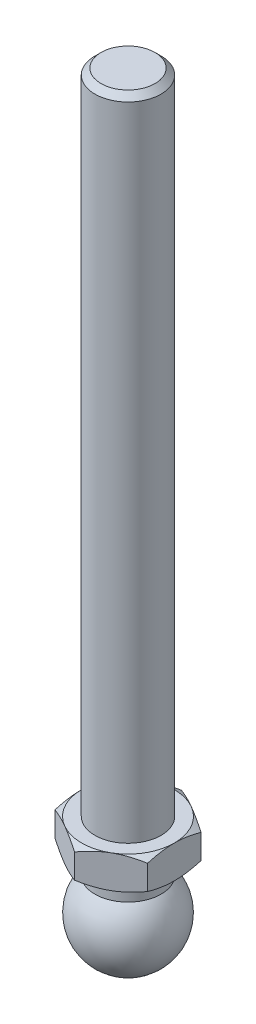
ISO-10303-21;
HEADER;
FILE_DESCRIPTION(('STEP AP214'),'2;1');
FILE_NAME('part.step','',(''),(''),'','','');
FILE_SCHEMA(('AUTOMOTIVE_DESIGN { 1 0 10303 214 1 1 1 1 }'));
ENDSEC;
DATA;
#1=APPLICATION_CONTEXT('core data for automotive mechanical design processes');
#2=APPLICATION_PROTOCOL_DEFINITION('international standard','automotive_design',2000,#1);
#3=PRODUCT_CONTEXT('',#1,'mechanical');
#4=PRODUCT('Part','Part','',(#3));
#5=PRODUCT_RELATED_PRODUCT_CATEGORY('part','',(#4));
#6=PRODUCT_DEFINITION_FORMATION('','',#4);
#7=PRODUCT_DEFINITION_CONTEXT('part definition',#1,'design');
#8=PRODUCT_DEFINITION('design','',#6,#7);
#9=PRODUCT_DEFINITION_SHAPE('','',#8);
#10=(LENGTH_UNIT() NAMED_UNIT(*) SI_UNIT(.MILLI.,.METRE.));
#11=(NAMED_UNIT(*) PLANE_ANGLE_UNIT() SI_UNIT($,.RADIAN.));
#12=(NAMED_UNIT(*) SI_UNIT($,.STERADIAN.) SOLID_ANGLE_UNIT());
#13=UNCERTAINTY_MEASURE_WITH_UNIT(LENGTH_MEASURE(1.E-05),#10,'distance_accuracy_value','');
#14=(GEOMETRIC_REPRESENTATION_CONTEXT(3) GLOBAL_UNCERTAINTY_ASSIGNED_CONTEXT((#13)) GLOBAL_UNIT_ASSIGNED_CONTEXT((#10,
#11,#12)) REPRESENTATION_CONTEXT('',''));
#15=CARTESIAN_POINT('',(0.,0.,0.));
#16=DIRECTION('',(0.,0.,1.));
#17=DIRECTION('',(1.,0.,0.));
#18=AXIS2_PLACEMENT_3D('',#15,#16,#17);
#19=CARTESIAN_POINT('',(0.,12.6,0.));
#20=DIRECTION('',(0.,-1.,0.));
#21=DIRECTION('',(0.,0.,-1.));
#22=AXIS2_PLACEMENT_3D('',#19,#20,#21);
#23=CONICAL_SURFACE('',#22,7.,1.0471975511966);
#24=CARTESIAN_POINT('',(-7.,8.53828268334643,12.1648696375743));
#25=CARTESIAN_POINT('',(-7.,8.68391573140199,11.8738003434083));
#26=CARTESIAN_POINT('',(-7.,8.82854589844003,11.5822239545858));
#27=CARTESIAN_POINT('',(-7.,9.11531569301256,10.997825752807));
#28=CARTESIAN_POINT('',(-7.,9.25745515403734,10.7050038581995));
#29=CARTESIAN_POINT('',(-7.,9.53902214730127,10.117331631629));
#30=CARTESIAN_POINT('',(-7.,9.67844364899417,9.8224784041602));
#31=CARTESIAN_POINT('',(-7.,9.95360604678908,9.23106328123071));
#32=CARTESIAN_POINT('',(-7.,10.0893470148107,8.9345014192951));
#33=CARTESIAN_POINT('',(-7.,10.3623110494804,8.325935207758));
#34=CARTESIAN_POINT('',(-7.,10.4993254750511,8.0138369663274));
#35=CARTESIAN_POINT('',(-7.,10.7671383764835,7.38695797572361));
#36=CARTESIAN_POINT('',(-7.,10.8979365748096,7.07217710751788));
#37=CARTESIAN_POINT('',(-7.,11.1515530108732,6.43962449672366));
#38=CARTESIAN_POINT('',(-7.,11.274376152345,6.12185473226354));
#39=CARTESIAN_POINT('',(-7.,11.5099016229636,5.4826031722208));
#40=CARTESIAN_POINT('',(-7.,11.6226050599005,5.16112178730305));
#41=CARTESIAN_POINT('',(-7.,11.8599014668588,4.43821731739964));
#42=CARTESIAN_POINT('',(-7.,11.981118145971,4.03566892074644));
#43=CARTESIAN_POINT('',(-7.,12.1969740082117,3.22331060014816));
#44=CARTESIAN_POINT('',(-7.,12.2916155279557,2.81350131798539));
#45=CARTESIAN_POINT('',(-7.,12.4069999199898,2.1974256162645));
#46=CARTESIAN_POINT('',(-7.,12.4408518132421,1.99359214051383));
#47=CARTESIAN_POINT('',(-7.,12.4993191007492,1.58461613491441));
#48=CARTESIAN_POINT('',(-7.,12.5239358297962,1.37947379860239));
#49=CARTESIAN_POINT('',(-7.,12.5631968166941,0.968289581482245));
#50=CARTESIAN_POINT('',(-7.,12.5778439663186,0.762247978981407));
#51=CARTESIAN_POINT('',(-7.,12.5967021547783,0.349683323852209));
#52=CARTESIAN_POINT('',(-7.,12.6009132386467,0.143160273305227));
#53=CARTESIAN_POINT('',(-7.,12.5987493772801,-0.271082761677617));
#54=CARTESIAN_POINT('',(-7.,12.5923100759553,-0.478802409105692));
#55=CARTESIAN_POINT('',(-7.,12.5689433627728,-0.893645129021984));
#56=CARTESIAN_POINT('',(-7.,12.5520159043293,-1.10076819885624));
#57=CARTESIAN_POINT('',(-7.,12.5082124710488,-1.5140304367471));
#58=CARTESIAN_POINT('',(-7.,12.4813327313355,-1.72016920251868));
#59=CARTESIAN_POINT('',(-7.,12.4184180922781,-2.13103319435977));
#60=CARTESIAN_POINT('',(-7.,12.3823828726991,-2.33575837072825));
#61=CARTESIAN_POINT('',(-7.,12.2605686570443,-2.95437912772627));
#62=CARTESIAN_POINT('',(-7.,12.1618729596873,-3.36575077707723));
#63=CARTESIAN_POINT('',(-7.,11.9384533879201,-4.18138012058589));
#64=CARTESIAN_POINT('',(-7.,11.8137148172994,-4.58563365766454));
#65=CARTESIAN_POINT('',(-7.,11.5733248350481,-5.30320893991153));
#66=CARTESIAN_POINT('',(-7.,11.4612875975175,-5.6177595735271));
#67=CARTESIAN_POINT('',(-7.,11.2278514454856,-6.24325021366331));
#68=CARTESIAN_POINT('',(-7.,11.1064551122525,-6.55419118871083));
#69=CARTESIAN_POINT('',(-7.,10.8562070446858,-7.17328528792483));
#70=CARTESIAN_POINT('',(-7.,10.7273503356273,-7.48143638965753));
#71=CARTESIAN_POINT('',(-7.,10.4637823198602,-8.09523802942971));
#72=CARTESIAN_POINT('',(-7.,10.3290706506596,-8.40088841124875));
#73=CARTESIAN_POINT('',(-7.,10.0607840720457,-8.99716345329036));
#74=CARTESIAN_POINT('',(-7.,9.92740317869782,-9.2878756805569));
#75=CARTESIAN_POINT('',(-7.,9.65714715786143,-9.86766295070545));
#76=CARTESIAN_POINT('',(-7.,9.52027208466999,-10.1567380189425));
#77=CARTESIAN_POINT('',(-7.,9.24389786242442,-10.7329937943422));
#78=CARTESIAN_POINT('',(-7.,9.10440383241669,-11.0201769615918));
#79=CARTESIAN_POINT('',(-7.,8.82302286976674,-11.5933594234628));
#80=CARTESIAN_POINT('',(-7.,8.68113600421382,-11.879358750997));
#81=CARTESIAN_POINT('',(-7.,8.53828268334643,-12.1648696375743));
#82=B_SPLINE_CURVE_WITH_KNOTS('',3,(#24,#25,#26,#27,#28,#29,#30,#31,#32,#33,#34,#35,#36,#37,#38,
#39,#40,#41,#42,#43,#44,#45,#46,#47,#48,#49,#50,#51,#52,#53,#54,#55,#56,#57,#58,#59,#60,#61,#62,
#63,#64,#65,#66,#67,#68,#69,#70,#71,#72,#73,#74,#75,#76,#77,#78,#79,#80,#81),.UNSPECIFIED.,.F.,
.F.,(4,2,2,2,2,2,2,2,2,2,2,2,2,2,2,2,2,2,2,2,2,2,2,2,2,2,2,2,4),(0.,0.976413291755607,
1.95289161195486,2.93133423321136,3.90975772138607,4.93225217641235,5.95479223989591,
6.97669748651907,7.99849072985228,9.25906449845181,10.5195273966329,11.1392271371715,
11.7588372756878,12.3782676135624,12.9976952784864,13.6208795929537,14.2440666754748,
14.8674897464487,15.490934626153,16.7587972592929,18.027377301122,19.0289263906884,
20.0302002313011,21.0321496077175,22.0341611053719,22.9936838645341,23.9531917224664,
24.9109871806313,25.8687558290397),.UNSPECIFIED.);
#83=CARTESIAN_POINT('',(-7.,11.9747852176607,4.04145188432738));
#84=VERTEX_POINT('',#83);
#85=CARTESIAN_POINT('',(-7.,12.6,0.));
#86=VERTEX_POINT('',#85);
#87=EDGE_CURVE('E309',#84,#86,#82,.T.);
#88=ORIENTED_EDGE('',*,*,#87,.F.);
#89=CARTESIAN_POINT('',(0.0002,11.9747185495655,8.0830192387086));
#90=CARTESIAN_POINT('',(-0.153667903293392,12.0260001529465,7.99418356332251));
#91=CARTESIAN_POINT('',(-0.30810950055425,12.0749544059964,7.90501666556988));
#92=CARTESIAN_POINT('',(-0.618246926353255,12.1675672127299,7.72595873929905));
#93=CARTESIAN_POINT('',(-0.773943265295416,12.2112234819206,7.63606741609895));
#94=CARTESIAN_POINT('',(-1.24352516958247,12.3333884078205,7.36495417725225));
#95=CARTESIAN_POINT('',(-1.5592643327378,12.402874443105,7.18266208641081));
#96=CARTESIAN_POINT('',(-2.03176224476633,12.4843550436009,6.9098652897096));
#97=CARTESIAN_POINT('',(-2.18710922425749,12.5075665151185,6.82017566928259));
#98=CARTESIAN_POINT('',(-2.49850511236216,12.5464887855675,6.64039116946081));
#99=CARTESIAN_POINT('',(-2.65455395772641,12.5622002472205,6.55029632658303));
#100=CARTESIAN_POINT('',(-2.96692267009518,12.5857220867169,6.36995016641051));
#101=CARTESIAN_POINT('',(-3.12324202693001,12.5935414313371,6.27969914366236));
#102=CARTESIAN_POINT('',(-3.43601650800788,12.6011197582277,6.09911871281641));
#103=CARTESIAN_POINT('',(-3.59247162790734,12.600878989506,6.00878930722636));
#104=CARTESIAN_POINT('',(-4.02110687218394,12.5891402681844,5.76131663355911));
#105=CARTESIAN_POINT('',(-4.2931466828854,12.5694342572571,5.60425437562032));
#106=CARTESIAN_POINT('',(-4.8354194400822,12.5069465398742,5.29117305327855));
#107=CARTESIAN_POINT('',(-5.10565047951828,12.464143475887,5.13515508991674));
#108=CARTESIAN_POINT('',(-5.64901454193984,12.3571483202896,4.82144370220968));
#109=CARTESIAN_POINT('',(-5.92207900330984,12.2925029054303,4.66378986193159));
#110=CARTESIAN_POINT('',(-6.46413578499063,12.145783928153,4.35083323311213));
#111=CARTESIAN_POINT('',(-6.73313504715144,12.0637448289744,4.19552643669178));
#112=CARTESIAN_POINT('',(-7.0002,11.9747185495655,4.04133641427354));
#113=B_SPLINE_CURVE_WITH_KNOTS('',3,(#89,#90,#91,#92,#93,#94,#95,#96,#97,#98,#99,#100,#101,#102,
#103,#104,#105,#106,#107,#108,#109,#110,#111,#112),.UNSPECIFIED.,.F.,.F.,(4,2,2,2,2,2,2,2,2,2,2,
4),(0.,0.554727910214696,1.10969417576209,2.2219327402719,2.76443041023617,3.30688013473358,
3.8487128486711,4.3905288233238,5.33376515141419,6.27787517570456,7.2429241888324,
8.20607866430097),.UNSPECIFIED.);
#114=CARTESIAN_POINT('',(-3.5,12.6,6.06217782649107));
#115=VERTEX_POINT('',#114);
#116=EDGE_CURVE('E135',#115,#84,#113,.T.);
#117=ORIENTED_EDGE('',*,*,#116,.F.);
#118=CARTESIAN_POINT('',(0.,12.6,0.));
#119=DIRECTION('',(0.,-1.,0.));
#120=DIRECTION('',(0.,0.,-1.));
#121=AXIS2_PLACEMENT_3D('',#118,#119,#120);
#122=CIRCLE('',#121,7.);
#123=EDGE_CURVE('E283',#115,#86,#122,.T.);
#124=ORIENTED_EDGE('',*,*,#123,.T.);
#125=EDGE_LOOP('',(#88,#117,#124));
#126=FACE_BOUND('',#125,.T.);
#127=ADVANCED_FACE('F14',(#126),#23,.T.);
#128=CARTESIAN_POINT('',(-7.,11.9747852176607,-4.04145188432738));
#129=VERTEX_POINT('',#128);
#130=EDGE_CURVE('E193',#86,#129,#82,.T.);
#131=ORIENTED_EDGE('',*,*,#130,.F.);
#132=CARTESIAN_POINT('',(-3.5,12.6,-6.06217782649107));
#133=VERTEX_POINT('',#132);
#134=EDGE_CURVE('E195',#86,#133,#122,.T.);
#135=ORIENTED_EDGE('',*,*,#134,.T.);
#136=CARTESIAN_POINT('',(-7.0002,11.9747185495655,-4.04133641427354));
#137=CARTESIAN_POINT('',(-6.84633209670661,12.0260001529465,-4.13017208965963));
#138=CARTESIAN_POINT('',(-6.69189049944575,12.0749544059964,-4.21933898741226));
#139=CARTESIAN_POINT('',(-6.38175307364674,12.1675672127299,-4.39839691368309));
#140=CARTESIAN_POINT('',(-6.22605673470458,12.2112234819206,-4.48828823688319));
#141=CARTESIAN_POINT('',(-5.75647483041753,12.3333884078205,-4.75940147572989));
#142=CARTESIAN_POINT('',(-5.4407356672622,12.402874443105,-4.94169356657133));
#143=CARTESIAN_POINT('',(-4.96823775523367,12.4843550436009,-5.21449036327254));
#144=CARTESIAN_POINT('',(-4.81289077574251,12.5075665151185,-5.30417998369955));
#145=CARTESIAN_POINT('',(-4.50149488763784,12.5464887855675,-5.48396448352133));
#146=CARTESIAN_POINT('',(-4.34544604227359,12.5622002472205,-5.57405932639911));
#147=CARTESIAN_POINT('',(-4.03307732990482,12.5857220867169,-5.75440548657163));
#148=CARTESIAN_POINT('',(-3.87675797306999,12.5935414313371,-5.84465650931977));
#149=CARTESIAN_POINT('',(-3.56398349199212,12.6011197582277,-6.02523694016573));
#150=CARTESIAN_POINT('',(-3.40752837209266,12.600878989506,-6.11556634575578));
#151=CARTESIAN_POINT('',(-2.97889312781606,12.5891402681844,-6.36303901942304));
#152=CARTESIAN_POINT('',(-2.7068533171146,12.5694342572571,-6.52010127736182));
#153=CARTESIAN_POINT('',(-2.1645805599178,12.5069465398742,-6.83318259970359));
#154=CARTESIAN_POINT('',(-1.89434952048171,12.464143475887,-6.9892005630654));
#155=CARTESIAN_POINT('',(-1.35098545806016,12.3571483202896,-7.30291195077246));
#156=CARTESIAN_POINT('',(-1.07792099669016,12.2925029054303,-7.46056579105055));
#157=CARTESIAN_POINT('',(-0.535864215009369,12.145783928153,-7.77352241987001));
#158=CARTESIAN_POINT('',(-0.266864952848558,12.0637448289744,-7.92882921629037));
#159=CARTESIAN_POINT('',(0.000200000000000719,11.9747185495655,-8.0830192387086));
#160=B_SPLINE_CURVE_WITH_KNOTS('',3,(#136,#137,#138,#139,#140,#141,#142,#143,#144,#145,#146,
#147,#148,#149,#150,#151,#152,#153,#154,#155,#156,#157,#158,#159),.UNSPECIFIED.,.F.,.F.,(4,2,2,
2,2,2,2,2,2,2,2,4),(0.,0.554727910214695,1.10969417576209,2.2219327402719,2.76443041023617,
3.30688013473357,3.8487128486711,4.39052882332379,5.33376515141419,6.27787517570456,
7.2429241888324,8.20607866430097),.UNSPECIFIED.);
#161=EDGE_CURVE('E183',#129,#133,#160,.T.);
#162=ORIENTED_EDGE('',*,*,#161,.F.);
#163=EDGE_LOOP('',(#131,#135,#162));
#164=FACE_BOUND('',#163,.T.);
#165=ADVANCED_FACE('F192',(#164),#23,.T.);
#166=CARTESIAN_POINT('',(0.,11.9747852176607,-8.08290376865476));
#167=VERTEX_POINT('',#166);
#168=EDGE_CURVE('E197',#133,#167,#160,.T.);
#169=ORIENTED_EDGE('',*,*,#168,.F.);
#170=CARTESIAN_POINT('',(3.5,12.6,-6.06217782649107));
#171=VERTEX_POINT('',#170);
#172=EDGE_CURVE('E293',#133,#171,#122,.T.);
#173=ORIENTED_EDGE('',*,*,#172,.T.);
#174=CARTESIAN_POINT('',(-0.0002,11.9747185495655,-8.0830192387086));
#175=CARTESIAN_POINT('',(0.153667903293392,12.0260001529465,-7.99418356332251));
#176=CARTESIAN_POINT('',(0.30810950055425,12.0749544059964,-7.90501666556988));
#177=CARTESIAN_POINT('',(0.618246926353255,12.1675672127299,-7.72595873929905));
#178=CARTESIAN_POINT('',(0.773943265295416,12.2112234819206,-7.63606741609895));
#179=CARTESIAN_POINT('',(1.24352516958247,12.3333884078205,-7.36495417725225));
#180=CARTESIAN_POINT('',(1.5592643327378,12.402874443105,-7.18266208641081));
#181=CARTESIAN_POINT('',(2.03176224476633,12.4843550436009,-6.9098652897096));
#182=CARTESIAN_POINT('',(2.18710922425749,12.5075665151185,-6.82017566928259));
#183=CARTESIAN_POINT('',(2.49850511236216,12.5464887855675,-6.64039116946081));
#184=CARTESIAN_POINT('',(2.65455395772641,12.5622002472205,-6.55029632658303));
#185=CARTESIAN_POINT('',(2.96692267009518,12.5857220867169,-6.36995016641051));
#186=CARTESIAN_POINT('',(3.12324202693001,12.5935414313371,-6.27969914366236));
#187=CARTESIAN_POINT('',(3.43601650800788,12.6011197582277,-6.09911871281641));
#188=CARTESIAN_POINT('',(3.59247162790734,12.600878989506,-6.00878930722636));
#189=CARTESIAN_POINT('',(4.02110687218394,12.5891402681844,-5.76131663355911));
#190=CARTESIAN_POINT('',(4.2931466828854,12.5694342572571,-5.60425437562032));
#191=CARTESIAN_POINT('',(4.8354194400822,12.5069465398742,-5.29117305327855));
#192=CARTESIAN_POINT('',(5.10565047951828,12.464143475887,-5.13515508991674));
#193=CARTESIAN_POINT('',(5.64901454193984,12.3571483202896,-4.82144370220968));
#194=CARTESIAN_POINT('',(5.92207900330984,12.2925029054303,-4.66378986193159));
#195=CARTESIAN_POINT('',(6.46413578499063,12.145783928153,-4.35083323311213));
#196=CARTESIAN_POINT('',(6.73313504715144,12.0637448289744,-4.19552643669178));
#197=CARTESIAN_POINT('',(7.0002,11.9747185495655,-4.04133641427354));
#198=B_SPLINE_CURVE_WITH_KNOTS('',3,(#174,#175,#176,#177,#178,#179,#180,#181,#182,#183,#184,
#185,#186,#187,#188,#189,#190,#191,#192,#193,#194,#195,#196,#197),.UNSPECIFIED.,.F.,.F.,(4,2,2,
2,2,2,2,2,2,2,2,4),(0.,0.554727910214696,1.10969417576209,2.2219327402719,2.76443041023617,
3.30688013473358,3.8487128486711,4.3905288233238,5.33376515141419,6.27787517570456,
7.2429241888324,8.20607866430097),.UNSPECIFIED.);
#199=EDGE_CURVE('E243',#167,#171,#198,.T.);
#200=ORIENTED_EDGE('',*,*,#199,.F.);
#201=EDGE_LOOP('',(#169,#173,#200));
#202=FACE_BOUND('',#201,.T.);
#203=ADVANCED_FACE('F342',(#202),#23,.T.);
#204=CARTESIAN_POINT('',(7.,11.9747852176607,-4.04145188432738));
#205=VERTEX_POINT('',#204);
#206=EDGE_CURVE('E238',#171,#205,#198,.T.);
#207=ORIENTED_EDGE('',*,*,#206,.F.);
#208=CARTESIAN_POINT('',(7.,12.6,0.));
#209=VERTEX_POINT('',#208);
#210=EDGE_CURVE('E288',#171,#209,#122,.T.);
#211=ORIENTED_EDGE('',*,*,#210,.T.);
#212=CARTESIAN_POINT('',(7.,8.53828268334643,-12.1648696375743));
#213=CARTESIAN_POINT('',(7.,8.68391573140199,-11.8738003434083));
#214=CARTESIAN_POINT('',(7.,8.82854589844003,-11.5822239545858));
#215=CARTESIAN_POINT('',(7.,9.11531569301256,-10.997825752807));
#216=CARTESIAN_POINT('',(7.,9.25745515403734,-10.7050038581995));
#217=CARTESIAN_POINT('',(7.,9.53902214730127,-10.117331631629));
#218=CARTESIAN_POINT('',(7.,9.67844364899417,-9.8224784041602));
#219=CARTESIAN_POINT('',(7.,9.95360604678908,-9.23106328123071));
#220=CARTESIAN_POINT('',(7.,10.0893470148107,-8.9345014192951));
#221=CARTESIAN_POINT('',(7.,10.3623110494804,-8.325935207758));
#222=CARTESIAN_POINT('',(7.,10.4993254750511,-8.0138369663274));
#223=CARTESIAN_POINT('',(7.,10.7671383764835,-7.38695797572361));
#224=CARTESIAN_POINT('',(7.,10.8979365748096,-7.07217710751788));
#225=CARTESIAN_POINT('',(7.,11.1515530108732,-6.43962449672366));
#226=CARTESIAN_POINT('',(7.,11.274376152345,-6.12185473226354));
#227=CARTESIAN_POINT('',(7.,11.5099016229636,-5.4826031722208));
#228=CARTESIAN_POINT('',(7.,11.6226050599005,-5.16112178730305));
#229=CARTESIAN_POINT('',(7.,11.8599014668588,-4.43821731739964));
#230=CARTESIAN_POINT('',(7.,11.981118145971,-4.03566892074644));
#231=CARTESIAN_POINT('',(7.,12.1969740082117,-3.22331060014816));
#232=CARTESIAN_POINT('',(7.,12.2916155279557,-2.81350131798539));
#233=CARTESIAN_POINT('',(7.,12.4069999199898,-2.1974256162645));
#234=CARTESIAN_POINT('',(7.,12.4408518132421,-1.99359214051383));
#235=CARTESIAN_POINT('',(7.,12.4993191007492,-1.58461613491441));
#236=CARTESIAN_POINT('',(7.,12.5239358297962,-1.37947379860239));
#237=CARTESIAN_POINT('',(7.,12.5631968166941,-0.968289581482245));
#238=CARTESIAN_POINT('',(7.,12.5778439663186,-0.762247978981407));
#239=CARTESIAN_POINT('',(7.,12.5967021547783,-0.349683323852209));
#240=CARTESIAN_POINT('',(7.,12.6009132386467,-0.143160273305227));
#241=CARTESIAN_POINT('',(7.,12.5987493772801,0.271082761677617));
#242=CARTESIAN_POINT('',(7.,12.5923100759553,0.478802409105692));
#243=CARTESIAN_POINT('',(7.,12.5689433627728,0.893645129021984));
#244=CARTESIAN_POINT('',(7.,12.5520159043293,1.10076819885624));
#245=CARTESIAN_POINT('',(7.,12.5082124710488,1.5140304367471));
#246=CARTESIAN_POINT('',(7.,12.4813327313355,1.72016920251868));
#247=CARTESIAN_POINT('',(7.,12.4184180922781,2.13103319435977));
#248=CARTESIAN_POINT('',(7.,12.3823828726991,2.33575837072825));
#249=CARTESIAN_POINT('',(7.,12.2605686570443,2.95437912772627));
#250=CARTESIAN_POINT('',(7.,12.1618729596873,3.36575077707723));
#251=CARTESIAN_POINT('',(7.,11.9384533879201,4.18138012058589));
#252=CARTESIAN_POINT('',(7.,11.8137148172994,4.58563365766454));
#253=CARTESIAN_POINT('',(7.,11.5733248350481,5.30320893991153));
#254=CARTESIAN_POINT('',(7.,11.4612875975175,5.6177595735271));
#255=CARTESIAN_POINT('',(7.,11.2278514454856,6.24325021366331));
#256=CARTESIAN_POINT('',(7.,11.1064551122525,6.55419118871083));
#257=CARTESIAN_POINT('',(7.,10.8562070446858,7.17328528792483));
#258=CARTESIAN_POINT('',(7.,10.7273503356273,7.48143638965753));
#259=CARTESIAN_POINT('',(7.,10.4637823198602,8.09523802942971));
#260=CARTESIAN_POINT('',(7.,10.3290706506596,8.40088841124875));
#261=CARTESIAN_POINT('',(7.,10.0607840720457,8.99716345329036));
#262=CARTESIAN_POINT('',(7.,9.92740317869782,9.2878756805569));
#263=CARTESIAN_POINT('',(7.,9.65714715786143,9.86766295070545));
#264=CARTESIAN_POINT('',(7.,9.52027208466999,10.1567380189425));
#265=CARTESIAN_POINT('',(7.,9.24389786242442,10.7329937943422));
#266=CARTESIAN_POINT('',(7.,9.10440383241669,11.0201769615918));
#267=CARTESIAN_POINT('',(7.,8.82302286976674,11.5933594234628));
#268=CARTESIAN_POINT('',(7.,8.68113600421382,11.879358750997));
#269=CARTESIAN_POINT('',(7.,8.53828268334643,12.1648696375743));
#270=B_SPLINE_CURVE_WITH_KNOTS('',3,(#212,#213,#214,#215,#216,#217,#218,#219,#220,#221,#222,
#223,#224,#225,#226,#227,#228,#229,#230,#231,#232,#233,#234,#235,#236,#237,#238,#239,#240,#241,
#242,#243,#244,#245,#246,#247,#248,#249,#250,#251,#252,#253,#254,#255,#256,#257,#258,#259,#260,
#261,#262,#263,#264,#265,#266,#267,#268,#269),.UNSPECIFIED.,.F.,.F.,(4,2,2,2,2,2,2,2,2,2,2,2,2,
2,2,2,2,2,2,2,2,2,2,2,2,2,2,2,4),(0.,0.976413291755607,1.95289161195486,2.93133423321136,
3.90975772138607,4.93225217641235,5.95479223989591,6.97669748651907,7.99849072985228,
9.25906449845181,10.5195273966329,11.1392271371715,11.7588372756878,12.3782676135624,
12.9976952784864,13.6208795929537,14.2440666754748,14.8674897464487,15.490934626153,
16.7587972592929,18.027377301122,19.0289263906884,20.0302002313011,21.0321496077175,
22.0341611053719,22.9936838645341,23.9531917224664,24.9109871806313,25.8687558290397),.UNSPECIFIED.);
#271=EDGE_CURVE('E249',#205,#209,#270,.T.);
#272=ORIENTED_EDGE('',*,*,#271,.F.);
#273=EDGE_LOOP('',(#207,#211,#272));
#274=FACE_BOUND('',#273,.T.);
#275=ADVANCED_FACE('F352',(#274),#23,.T.);
#276=CARTESIAN_POINT('',(7.,11.9747852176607,4.04145188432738));
#277=VERTEX_POINT('',#276);
#278=EDGE_CURVE('E251',#209,#277,#270,.T.);
#279=ORIENTED_EDGE('',*,*,#278,.F.);
#280=CARTESIAN_POINT('',(3.5,12.6,6.06217782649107));
#281=VERTEX_POINT('',#280);
#282=EDGE_CURVE('E281',#209,#281,#122,.T.);
#283=ORIENTED_EDGE('',*,*,#282,.T.);
#284=CARTESIAN_POINT('',(7.0002,11.9747185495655,4.04133641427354));
#285=CARTESIAN_POINT('',(6.84633209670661,12.0260001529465,4.13017208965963));
#286=CARTESIAN_POINT('',(6.69189049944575,12.0749544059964,4.21933898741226));
#287=CARTESIAN_POINT('',(6.38175307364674,12.1675672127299,4.39839691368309));
#288=CARTESIAN_POINT('',(6.22605673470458,12.2112234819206,4.48828823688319));
#289=CARTESIAN_POINT('',(5.75647483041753,12.3333884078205,4.75940147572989));
#290=CARTESIAN_POINT('',(5.4407356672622,12.402874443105,4.94169356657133));
#291=CARTESIAN_POINT('',(4.96823775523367,12.4843550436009,5.21449036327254));
#292=CARTESIAN_POINT('',(4.81289077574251,12.5075665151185,5.30417998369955));
#293=CARTESIAN_POINT('',(4.50149488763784,12.5464887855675,5.48396448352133));
#294=CARTESIAN_POINT('',(4.34544604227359,12.5622002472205,5.57405932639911));
#295=CARTESIAN_POINT('',(4.03307732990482,12.5857220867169,5.75440548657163));
#296=CARTESIAN_POINT('',(3.87675797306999,12.5935414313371,5.84465650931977));
#297=CARTESIAN_POINT('',(3.56398349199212,12.6011197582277,6.02523694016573));
#298=CARTESIAN_POINT('',(3.40752837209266,12.600878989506,6.11556634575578));
#299=CARTESIAN_POINT('',(2.97889312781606,12.5891402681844,6.36303901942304));
#300=CARTESIAN_POINT('',(2.7068533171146,12.5694342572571,6.52010127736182));
#301=CARTESIAN_POINT('',(2.1645805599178,12.5069465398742,6.83318259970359));
#302=CARTESIAN_POINT('',(1.89434952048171,12.464143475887,6.9892005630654));
#303=CARTESIAN_POINT('',(1.35098545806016,12.3571483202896,7.30291195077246));
#304=CARTESIAN_POINT('',(1.07792099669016,12.2925029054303,7.46056579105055));
#305=CARTESIAN_POINT('',(0.535864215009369,12.145783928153,7.77352241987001));
#306=CARTESIAN_POINT('',(0.266864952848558,12.0637448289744,7.92882921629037));
#307=CARTESIAN_POINT('',(-0.000200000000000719,11.9747185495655,8.0830192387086));
#308=B_SPLINE_CURVE_WITH_KNOTS('',3,(#284,#285,#286,#287,#288,#289,#290,#291,#292,#293,#294,
#295,#296,#297,#298,#299,#300,#301,#302,#303,#304,#305,#306,#307),.UNSPECIFIED.,.F.,.F.,(4,2,2,
2,2,2,2,2,2,2,2,4),(0.,0.554727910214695,1.10969417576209,2.2219327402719,2.76443041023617,
3.30688013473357,3.8487128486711,4.39052882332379,5.33376515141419,6.27787517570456,
7.2429241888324,8.20607866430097),.UNSPECIFIED.);
#309=EDGE_CURVE('E126',#277,#281,#308,.T.);
#310=ORIENTED_EDGE('',*,*,#309,.F.);
#311=EDGE_LOOP('',(#279,#283,#310));
#312=FACE_BOUND('',#311,.T.);
#313=ADVANCED_FACE('F285',(#312),#23,.T.);
#314=CARTESIAN_POINT('',(0.,11.9747852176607,8.08290376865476));
#315=VERTEX_POINT('',#314);
#316=EDGE_CURVE('E116',#281,#315,#308,.T.);
#317=ORIENTED_EDGE('',*,*,#316,.F.);
#318=EDGE_CURVE('E274',#281,#115,#122,.T.);
#319=ORIENTED_EDGE('',*,*,#318,.T.);
#320=EDGE_CURVE('E29',#315,#115,#113,.T.);
#321=ORIENTED_EDGE('',*,*,#320,.F.);
#322=EDGE_LOOP('',(#317,#319,#321));
#323=FACE_BOUND('',#322,.T.);
#324=ADVANCED_FACE('F273',(#323),#23,.T.);
#325=CARTESIAN_POINT('',(0.,110.6,0.));
#326=DIRECTION('',(0.,-1.,0.));
#327=DIRECTION('',(0.,0.,-1.));
#328=AXIS2_PLACEMENT_3D('',#325,#326,#327);
#329=PLANE('',#328);
#330=CARTESIAN_POINT('',(0.,110.6,0.));
#331=DIRECTION('',(0.,-1.,0.));
#332=DIRECTION('',(0.,0.,-1.));
#333=AXIS2_PLACEMENT_3D('',#330,#331,#332);
#334=CIRCLE('',#333,4.08);
#335=CARTESIAN_POINT('',(0.,110.6,-4.08));
#336=VERTEX_POINT('',#335);
#337=EDGE_CURVE('E22',#336,#336,#334,.T.);
#338=ORIENTED_EDGE('',*,*,#337,.F.);
#339=EDGE_LOOP('',(#338));
#340=FACE_BOUND('',#339,.T.);
#341=ADVANCED_FACE('F16',(#340),#329,.F.);
#342=CARTESIAN_POINT('',(0.,110.6,0.));
#343=DIRECTION('',(0.,-1.,0.));
#344=DIRECTION('',(0.,0.,-1.));
#345=AXIS2_PLACEMENT_3D('',#342,#343,#344);
#346=CONICAL_SURFACE('',#345,4.08,0.785398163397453);
#347=CARTESIAN_POINT('',(0.,109.68,0.));
#348=DIRECTION('',(0.,-1.,0.));
#349=DIRECTION('',(0.,0.,-1.));
#350=AXIS2_PLACEMENT_3D('',#347,#348,#349);
#351=CIRCLE('',#350,5.);
#352=CARTESIAN_POINT('',(0.,109.68,-5.));
#353=VERTEX_POINT('',#352);
#354=EDGE_CURVE('E290',#353,#353,#351,.T.);
#355=ORIENTED_EDGE('',*,*,#354,.F.);
#356=EDGE_LOOP('',(#355));
#357=FACE_BOUND('',#356,.T.);
#358=ORIENTED_EDGE('',*,*,#337,.T.);
#359=EDGE_LOOP('',(#358));
#360=FACE_BOUND('',#359,.T.);
#361=ADVANCED_FACE('F350',(#357,#360),#346,.T.);
#362=CARTESIAN_POINT('',(0.,-7.,0.));
#363=DIRECTION('',(0.,-1.,0.));
#364=DIRECTION('',(0.,0.,-1.));
#365=AXIS2_PLACEMENT_3D('',#362,#363,#364);
#366=CYLINDRICAL_SURFACE('',#365,5.);
#367=CARTESIAN_POINT('',(0.,12.6,0.));
#368=DIRECTION('',(0.,-1.,0.));
#369=DIRECTION('',(0.,0.,-1.));
#370=AXIS2_PLACEMENT_3D('',#367,#368,#369);
#371=CIRCLE('',#370,5.);
#372=CARTESIAN_POINT('',(0.,12.6,-5.));
#373=VERTEX_POINT('',#372);
#374=EDGE_CURVE('E287',#373,#373,#371,.T.);
#375=ORIENTED_EDGE('',*,*,#374,.F.);
#376=EDGE_LOOP('',(#375));
#377=FACE_BOUND('',#376,.T.);
#378=ORIENTED_EDGE('',*,*,#354,.T.);
#379=EDGE_LOOP('',(#378));
#380=FACE_BOUND('',#379,.T.);
#381=ADVANCED_FACE('F427',(#377,#380),#366,.T.);
#382=CARTESIAN_POINT('',(5.,12.6,0.));
#383=DIRECTION('',(0.,-1.,0.));
#384=DIRECTION('',(0.,0.,-1.));
#385=AXIS2_PLACEMENT_3D('',#382,#383,#384);
#386=PLANE('',#385);
#387=ORIENTED_EDGE('',*,*,#282,.F.);
#388=ORIENTED_EDGE('',*,*,#210,.F.);
#389=ORIENTED_EDGE('',*,*,#172,.F.);
#390=ORIENTED_EDGE('',*,*,#134,.F.);
#391=ORIENTED_EDGE('',*,*,#123,.F.);
#392=ORIENTED_EDGE('',*,*,#318,.F.);
#393=EDGE_LOOP('',(#387,#388,#389,#390,#391,#392));
#394=FACE_BOUND('',#393,.T.);
#395=ORIENTED_EDGE('',*,*,#374,.T.);
#396=EDGE_LOOP('',(#395));
#397=FACE_BOUND('',#396,.T.);
#398=ADVANCED_FACE('F278',(#394,#397),#386,.F.);
#399=CARTESIAN_POINT('',(-7.,7.65,-4.04145188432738));
#400=DIRECTION('',(-1.,0.,0.));
#401=DIRECTION('',(0.,0.,1.));
#402=AXIS2_PLACEMENT_3D('',#399,#400,#401);
#403=PLANE('',#402);
#404=ORIENTED_EDGE('',*,*,#87,.T.);
#405=ORIENTED_EDGE('',*,*,#130,.T.);
#406=DIRECTION('',(0.,1.,0.));
#407=VECTOR('',#406,1.);
#408=CARTESIAN_POINT('',(-7.,7.65,-4.04145188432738));
#409=LINE('',#408,#407);
#410=CARTESIAN_POINT('',(-7.,8.27521478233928,-4.04145188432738));
#411=VERTEX_POINT('',#410);
#412=EDGE_CURVE('E109',#411,#129,#409,.T.);
#413=ORIENTED_EDGE('',*,*,#412,.F.);
#414=CARTESIAN_POINT('',(-7.,11.7117173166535,-12.1648696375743));
#415=CARTESIAN_POINT('',(-7.,11.566084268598,-11.8738003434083));
#416=CARTESIAN_POINT('',(-7.,11.42145410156,-11.5822239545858));
#417=CARTESIAN_POINT('',(-7.,11.1346843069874,-10.997825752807));
#418=CARTESIAN_POINT('',(-7.,10.9925448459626,-10.7050038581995));
#419=CARTESIAN_POINT('',(-7.,10.7109778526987,-10.1173316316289));
#420=CARTESIAN_POINT('',(-7.,10.5715563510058,-9.82247840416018));
#421=CARTESIAN_POINT('',(-7.,10.2963939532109,-9.23106328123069));
#422=CARTESIAN_POINT('',(-7.,10.1606529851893,-8.93450141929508));
#423=CARTESIAN_POINT('',(-7.,9.8876889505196,-8.32593520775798));
#424=CARTESIAN_POINT('',(-7.,9.75067452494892,-8.01383696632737));
#425=CARTESIAN_POINT('',(-7.,9.48286162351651,-7.38695797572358));
#426=CARTESIAN_POINT('',(-7.,9.35206342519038,-7.07217710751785));
#427=CARTESIAN_POINT('',(-7.,9.09844698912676,-6.43962449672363));
#428=CARTESIAN_POINT('',(-7.,8.97562384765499,-6.12185473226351));
#429=CARTESIAN_POINT('',(-7.,8.74009837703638,-5.48260317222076));
#430=CARTESIAN_POINT('',(-7.,8.62739494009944,-5.16112178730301));
#431=CARTESIAN_POINT('',(-7.,8.39009853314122,-4.4382173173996));
#432=CARTESIAN_POINT('',(-7.,8.26888185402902,-4.03566892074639));
#433=CARTESIAN_POINT('',(-7.,8.05302599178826,-3.22331060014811));
#434=CARTESIAN_POINT('',(-7.,7.9583844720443,-2.81350131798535));
#435=CARTESIAN_POINT('',(-7.,7.84300008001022,-2.19742561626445));
#436=CARTESIAN_POINT('',(-7.,7.8091481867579,-1.99359214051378));
#437=CARTESIAN_POINT('',(-7.,7.75068089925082,-1.58461613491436));
#438=CARTESIAN_POINT('',(-7.,7.72606417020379,-1.37947379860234));
#439=CARTESIAN_POINT('',(-7.,7.68680318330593,-0.968289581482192));
#440=CARTESIAN_POINT('',(-7.,7.67215603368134,-0.762247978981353));
#441=CARTESIAN_POINT('',(-7.,7.65329784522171,-0.349683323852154));
#442=CARTESIAN_POINT('',(-7.,7.6490867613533,-0.143160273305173));
#443=CARTESIAN_POINT('',(-7.,7.65125062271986,0.271082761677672));
#444=CARTESIAN_POINT('',(-7.,7.65768992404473,0.478802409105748));
#445=CARTESIAN_POINT('',(-7.,7.68105663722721,0.893645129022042));
#446=CARTESIAN_POINT('',(-7.,7.69798409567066,1.1007681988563));
#447=CARTESIAN_POINT('',(-7.,7.74178752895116,1.51403043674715));
#448=CARTESIAN_POINT('',(-7.,7.76866726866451,1.72016920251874));
#449=CARTESIAN_POINT('',(-7.,7.83158190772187,2.13103319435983));
#450=CARTESIAN_POINT('',(-7.,7.86761712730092,2.33575837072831));
#451=CARTESIAN_POINT('',(-7.,7.98943134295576,2.95437912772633));
#452=CARTESIAN_POINT('',(-7.,8.08812704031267,3.3657507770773));
#453=CARTESIAN_POINT('',(-7.,8.31154661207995,4.18138012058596));
#454=CARTESIAN_POINT('',(-7.,8.43628518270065,4.58563365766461));
#455=CARTESIAN_POINT('',(-7.,8.67667516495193,5.30320893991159));
#456=CARTESIAN_POINT('',(-7.,8.78871240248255,5.61775957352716));
#457=CARTESIAN_POINT('',(-7.,9.02214855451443,6.24325021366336));
#458=CARTESIAN_POINT('',(-7.,9.14354488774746,6.55419118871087));
#459=CARTESIAN_POINT('',(-7.,9.3937929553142,7.17328528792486));
#460=CARTESIAN_POINT('',(-7.,9.52264966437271,7.48143638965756));
#461=CARTESIAN_POINT('',(-7.,9.78621768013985,8.09523802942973));
#462=CARTESIAN_POINT('',(-7.,9.92092934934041,8.40088841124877));
#463=CARTESIAN_POINT('',(-7.,10.1892159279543,8.99716345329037));
#464=CARTESIAN_POINT('',(-7.,10.3225968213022,9.28787568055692));
#465=CARTESIAN_POINT('',(-7.,10.5928528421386,9.86766295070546));
#466=CARTESIAN_POINT('',(-7.,10.72972791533,10.1567380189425));
#467=CARTESIAN_POINT('',(-7.,11.0061021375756,10.7329937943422));
#468=CARTESIAN_POINT('',(-7.,11.1455961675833,11.0201769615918));
#469=CARTESIAN_POINT('',(-7.,11.4269771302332,11.5933594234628));
#470=CARTESIAN_POINT('',(-7.,11.5688639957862,11.879358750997));
#471=CARTESIAN_POINT('',(-7.,11.7117173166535,12.1648696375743));
#472=B_SPLINE_CURVE_WITH_KNOTS('',3,(#414,#415,#416,#417,#418,#419,#420,#421,#422,#423,#424,
#425,#426,#427,#428,#429,#430,#431,#432,#433,#434,#435,#436,#437,#438,#439,#440,#441,#442,#443,
#444,#445,#446,#447,#448,#449,#450,#451,#452,#453,#454,#455,#456,#457,#458,#459,#460,#461,#462,
#463,#464,#465,#466,#467,#468,#469,#470,#471),.UNSPECIFIED.,.F.,.F.,(4,2,2,2,2,2,2,2,2,2,2,2,2,
2,2,2,2,2,2,2,2,2,2,2,2,2,2,2,4),(0.,0.976413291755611,1.95289161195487,2.93133423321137,
3.90975772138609,4.93225217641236,5.95479223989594,6.9766974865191,7.99849072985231,
9.25906449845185,10.5195273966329,11.1392271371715,11.7588372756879,12.3782676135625,
12.9976952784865,13.6208795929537,14.2440666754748,14.8674897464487,15.490934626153,
16.758797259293,18.0273773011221,19.0289263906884,20.0302002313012,21.0321496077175,
22.0341611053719,22.9936838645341,23.9531917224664,24.9109871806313,25.8687558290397),.UNSPECIFIED.);
#473=CARTESIAN_POINT('',(-7.,7.65,0.));
#474=VERTEX_POINT('',#473);
#475=EDGE_CURVE('E199',#411,#474,#472,.T.);
#476=ORIENTED_EDGE('',*,*,#475,.T.);
#477=CARTESIAN_POINT('',(-7.,8.27521478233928,4.04145188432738));
#478=VERTEX_POINT('',#477);
#479=EDGE_CURVE('E196',#474,#478,#472,.T.);
#480=ORIENTED_EDGE('',*,*,#479,.T.);
#481=DIRECTION('',(0.,1.,0.));
#482=VECTOR('',#481,1.);
#483=CARTESIAN_POINT('',(-7.,7.65,4.04145188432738));
#484=LINE('',#483,#482);
#485=EDGE_CURVE('E118',#478,#84,#484,.T.);
#486=ORIENTED_EDGE('',*,*,#485,.T.);
#487=EDGE_LOOP('',(#404,#405,#413,#476,#480,#486));
#488=FACE_BOUND('',#487,.T.);
#489=ADVANCED_FACE('F224',(#488),#403,.T.);
#490=CARTESIAN_POINT('',(0.,7.65,-8.08290376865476));
#491=DIRECTION('',(-0.5,0.,-0.866025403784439));
#492=DIRECTION('',(-0.866025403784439,0.,0.5));
#493=AXIS2_PLACEMENT_3D('',#490,#491,#492);
#494=PLANE('',#493);
#495=ORIENTED_EDGE('',*,*,#161,.T.);
#496=ORIENTED_EDGE('',*,*,#168,.T.);
#497=DIRECTION('',(0.,1.,0.));
#498=VECTOR('',#497,1.);
#499=CARTESIAN_POINT('',(0.,7.65,-8.08290376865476));
#500=LINE('',#499,#498);
#501=CARTESIAN_POINT('',(0.,8.27521478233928,-8.08290376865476));
#502=VERTEX_POINT('',#501);
#503=EDGE_CURVE('E175',#502,#167,#500,.T.);
#504=ORIENTED_EDGE('',*,*,#503,.F.);
#505=CARTESIAN_POINT('',(0.0002,8.27528145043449,-8.0830192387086));
#506=CARTESIAN_POINT('',(-0.153667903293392,8.22399984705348,-7.99418356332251));
#507=CARTESIAN_POINT('',(-0.30810950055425,8.17504559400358,-7.90501666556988));
#508=CARTESIAN_POINT('',(-0.618246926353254,8.08243278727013,-7.72595873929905));
#509=CARTESIAN_POINT('',(-0.773943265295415,8.03877651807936,-7.63606741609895));
#510=CARTESIAN_POINT('',(-1.24352516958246,7.91661159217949,-7.36495417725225));
#511=CARTESIAN_POINT('',(-1.5592643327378,7.84712555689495,-7.18266208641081));
#512=CARTESIAN_POINT('',(-2.03176224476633,7.76564495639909,-6.9098652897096));
#513=CARTESIAN_POINT('',(-2.18710922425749,7.74243348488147,-6.82017566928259));
#514=CARTESIAN_POINT('',(-2.49850511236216,7.70351121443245,-6.64039116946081));
#515=CARTESIAN_POINT('',(-2.65455395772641,7.68779975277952,-6.55029632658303));
#516=CARTESIAN_POINT('',(-2.96692267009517,7.66427791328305,-6.36995016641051));
#517=CARTESIAN_POINT('',(-3.12324202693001,7.65645856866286,-6.27969914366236));
#518=CARTESIAN_POINT('',(-3.43601650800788,7.6488802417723,-6.09911871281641));
#519=CARTESIAN_POINT('',(-3.59247162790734,7.64912101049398,-6.00878930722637));
#520=CARTESIAN_POINT('',(-4.02110687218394,7.66085973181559,-5.76131663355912));
#521=CARTESIAN_POINT('',(-4.2931466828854,7.68056574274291,-5.60425437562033));
#522=CARTESIAN_POINT('',(-4.83541944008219,7.74305346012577,-5.29117305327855));
#523=CARTESIAN_POINT('',(-5.10565047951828,7.78585652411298,-5.13515508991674));
#524=CARTESIAN_POINT('',(-5.64901454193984,7.89285167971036,-4.82144370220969));
#525=CARTESIAN_POINT('',(-5.92207900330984,7.95749709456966,-4.66378986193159));
#526=CARTESIAN_POINT('',(-6.46413578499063,8.10421607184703,-4.35083323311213));
#527=CARTESIAN_POINT('',(-6.73313504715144,8.18625517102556,-4.19552643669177));
#528=CARTESIAN_POINT('',(-7.0002,8.27528145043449,-4.04133641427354));
#529=B_SPLINE_CURVE_WITH_KNOTS('',3,(#505,#506,#507,#508,#509,#510,#511,#512,#513,#514,#515,
#516,#517,#518,#519,#520,#521,#522,#523,#524,#525,#526,#527,#528),.UNSPECIFIED.,.F.,.F.,(4,2,2,
2,2,2,2,2,2,2,2,4),(0.,0.554727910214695,1.10969417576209,2.2219327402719,2.76443041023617,
3.30688013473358,3.8487128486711,4.39052882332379,5.33376515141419,6.27787517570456,
7.2429241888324,8.20607866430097),.UNSPECIFIED.);
#530=CARTESIAN_POINT('',(-3.5,7.65,-6.06217782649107));
#531=VERTEX_POINT('',#530);
#532=EDGE_CURVE('E201',#502,#531,#529,.T.);
#533=ORIENTED_EDGE('',*,*,#532,.T.);
#534=EDGE_CURVE('E186',#531,#411,#529,.T.);
#535=ORIENTED_EDGE('',*,*,#534,.T.);
#536=ORIENTED_EDGE('',*,*,#412,.T.);
#537=EDGE_LOOP('',(#495,#496,#504,#533,#535,#536));
#538=FACE_BOUND('',#537,.T.);
#539=ADVANCED_FACE('F182',(#538),#494,.T.);
#540=CARTESIAN_POINT('',(7.,7.65,-4.04145188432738));
#541=DIRECTION('',(0.5,0.,-0.866025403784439));
#542=DIRECTION('',(-0.866025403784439,0.,-0.5));
#543=AXIS2_PLACEMENT_3D('',#540,#541,#542);
#544=PLANE('',#543);
#545=ORIENTED_EDGE('',*,*,#199,.T.);
#546=ORIENTED_EDGE('',*,*,#206,.T.);
#547=DIRECTION('',(0.,1.,0.));
#548=VECTOR('',#547,1.);
#549=CARTESIAN_POINT('',(7.,7.65,-4.04145188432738));
#550=LINE('',#549,#548);
#551=CARTESIAN_POINT('',(7.,8.27521478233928,-4.04145188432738));
#552=VERTEX_POINT('',#551);
#553=EDGE_CURVE('E172',#552,#205,#550,.T.);
#554=ORIENTED_EDGE('',*,*,#553,.F.);
#555=CARTESIAN_POINT('',(7.0002,8.27528145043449,-4.04133641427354));
#556=CARTESIAN_POINT('',(6.84633209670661,8.22399984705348,-4.13017208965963));
#557=CARTESIAN_POINT('',(6.69189049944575,8.17504559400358,-4.21933898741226));
#558=CARTESIAN_POINT('',(6.38175307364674,8.08243278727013,-4.39839691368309));
#559=CARTESIAN_POINT('',(6.22605673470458,8.03877651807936,-4.48828823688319));
#560=CARTESIAN_POINT('',(5.75647483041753,7.91661159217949,-4.75940147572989));
#561=CARTESIAN_POINT('',(5.4407356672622,7.84712555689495,-4.94169356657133));
#562=CARTESIAN_POINT('',(4.96823775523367,7.76564495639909,-5.21449036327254));
#563=CARTESIAN_POINT('',(4.81289077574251,7.74243348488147,-5.30417998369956));
#564=CARTESIAN_POINT('',(4.50149488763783,7.70351121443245,-5.48396448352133));
#565=CARTESIAN_POINT('',(4.34544604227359,7.68779975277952,-5.57405932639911));
#566=CARTESIAN_POINT('',(4.03307732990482,7.66427791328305,-5.75440548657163));
#567=CARTESIAN_POINT('',(3.87675797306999,7.65645856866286,-5.84465650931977));
#568=CARTESIAN_POINT('',(3.56398349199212,7.6488802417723,-6.02523694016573));
#569=CARTESIAN_POINT('',(3.40752837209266,7.64912101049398,-6.11556634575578));
#570=CARTESIAN_POINT('',(2.97889312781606,7.66085973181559,-6.36303901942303));
#571=CARTESIAN_POINT('',(2.7068533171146,7.68056574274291,-6.52010127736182));
#572=CARTESIAN_POINT('',(2.1645805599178,7.74305346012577,-6.83318259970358));
#573=CARTESIAN_POINT('',(1.89434952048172,7.78585652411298,-6.9892005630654));
#574=CARTESIAN_POINT('',(1.35098545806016,7.89285167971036,-7.30291195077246));
#575=CARTESIAN_POINT('',(1.07792099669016,7.95749709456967,-7.46056579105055));
#576=CARTESIAN_POINT('',(0.535864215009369,8.10421607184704,-7.77352241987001));
#577=CARTESIAN_POINT('',(0.266864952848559,8.18625517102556,-7.92882921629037));
#578=CARTESIAN_POINT('',(-0.000199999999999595,8.2752814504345,-8.0830192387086));
#579=B_SPLINE_CURVE_WITH_KNOTS('',3,(#555,#556,#557,#558,#559,#560,#561,#562,#563,#564,#565,
#566,#567,#568,#569,#570,#571,#572,#573,#574,#575,#576,#577,#578),.UNSPECIFIED.,.F.,.F.,(4,2,2,
2,2,2,2,2,2,2,2,4),(0.,0.554727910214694,1.10969417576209,2.2219327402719,2.76443041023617,
3.30688013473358,3.8487128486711,4.39052882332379,5.33376515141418,6.27787517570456,
7.2429241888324,8.20607866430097),.UNSPECIFIED.);
#580=CARTESIAN_POINT('',(3.5,7.65,-6.06217782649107));
#581=VERTEX_POINT('',#580);
#582=EDGE_CURVE('E244',#552,#581,#579,.T.);
#583=ORIENTED_EDGE('',*,*,#582,.T.);
#584=EDGE_CURVE('E232',#581,#502,#579,.T.);
#585=ORIENTED_EDGE('',*,*,#584,.T.);
#586=ORIENTED_EDGE('',*,*,#503,.T.);
#587=EDGE_LOOP('',(#545,#546,#554,#583,#585,#586));
#588=FACE_BOUND('',#587,.T.);
#589=ADVANCED_FACE('F223',(#588),#544,.T.);
#590=CARTESIAN_POINT('',(7.,7.65,4.04145188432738));
#591=DIRECTION('',(1.,0.,0.));
#592=DIRECTION('',(0.,0.,-1.));
#593=AXIS2_PLACEMENT_3D('',#590,#591,#592);
#594=PLANE('',#593);
#595=ORIENTED_EDGE('',*,*,#271,.T.);
#596=ORIENTED_EDGE('',*,*,#278,.T.);
#597=DIRECTION('',(0.,1.,0.));
#598=VECTOR('',#597,1.);
#599=CARTESIAN_POINT('',(7.,7.65,4.04145188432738));
#600=LINE('',#599,#598);
#601=CARTESIAN_POINT('',(7.,8.27521478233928,4.04145188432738));
#602=VERTEX_POINT('',#601);
#603=EDGE_CURVE('E117',#602,#277,#600,.T.);
#604=ORIENTED_EDGE('',*,*,#603,.F.);
#605=CARTESIAN_POINT('',(7.,11.7117173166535,12.1648696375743));
#606=CARTESIAN_POINT('',(7.,11.566084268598,11.8738003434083));
#607=CARTESIAN_POINT('',(7.,11.42145410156,11.5822239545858));
#608=CARTESIAN_POINT('',(7.,11.1346843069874,10.997825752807));
#609=CARTESIAN_POINT('',(7.,10.9925448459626,10.7050038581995));
#610=CARTESIAN_POINT('',(7.,10.7109778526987,10.1173316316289));
#611=CARTESIAN_POINT('',(7.,10.5715563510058,9.82247840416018));
#612=CARTESIAN_POINT('',(7.,10.2963939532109,9.23106328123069));
#613=CARTESIAN_POINT('',(7.,10.1606529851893,8.93450141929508));
#614=CARTESIAN_POINT('',(7.,9.8876889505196,8.32593520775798));
#615=CARTESIAN_POINT('',(7.,9.75067452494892,8.01383696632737));
#616=CARTESIAN_POINT('',(7.,9.48286162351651,7.38695797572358));
#617=CARTESIAN_POINT('',(7.,9.35206342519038,7.07217710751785));
#618=CARTESIAN_POINT('',(7.,9.09844698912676,6.43962449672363));
#619=CARTESIAN_POINT('',(7.,8.97562384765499,6.12185473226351));
#620=CARTESIAN_POINT('',(7.,8.74009837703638,5.48260317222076));
#621=CARTESIAN_POINT('',(7.,8.62739494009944,5.16112178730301));
#622=CARTESIAN_POINT('',(7.,8.39009853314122,4.4382173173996));
#623=CARTESIAN_POINT('',(7.,8.26888185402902,4.03566892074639));
#624=CARTESIAN_POINT('',(7.,8.05302599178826,3.22331060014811));
#625=CARTESIAN_POINT('',(7.,7.9583844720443,2.81350131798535));
#626=CARTESIAN_POINT('',(7.,7.84300008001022,2.19742561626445));
#627=CARTESIAN_POINT('',(7.,7.8091481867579,1.99359214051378));
#628=CARTESIAN_POINT('',(7.,7.75068089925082,1.58461613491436));
#629=CARTESIAN_POINT('',(7.,7.72606417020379,1.37947379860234));
#630=CARTESIAN_POINT('',(7.,7.68680318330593,0.968289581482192));
#631=CARTESIAN_POINT('',(7.,7.67215603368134,0.762247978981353));
#632=CARTESIAN_POINT('',(7.,7.65329784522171,0.349683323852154));
#633=CARTESIAN_POINT('',(7.,7.6490867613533,0.143160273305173));
#634=CARTESIAN_POINT('',(7.,7.65125062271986,-0.271082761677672));
#635=CARTESIAN_POINT('',(7.,7.65768992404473,-0.478802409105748));
#636=CARTESIAN_POINT('',(7.,7.68105663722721,-0.893645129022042));
#637=CARTESIAN_POINT('',(7.,7.69798409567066,-1.1007681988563));
#638=CARTESIAN_POINT('',(7.,7.74178752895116,-1.51403043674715));
#639=CARTESIAN_POINT('',(7.,7.76866726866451,-1.72016920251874));
#640=CARTESIAN_POINT('',(7.,7.83158190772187,-2.13103319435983));
#641=CARTESIAN_POINT('',(7.,7.86761712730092,-2.33575837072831));
#642=CARTESIAN_POINT('',(7.,7.98943134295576,-2.95437912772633));
#643=CARTESIAN_POINT('',(7.,8.08812704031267,-3.3657507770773));
#644=CARTESIAN_POINT('',(7.,8.31154661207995,-4.18138012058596));
#645=CARTESIAN_POINT('',(7.,8.43628518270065,-4.58563365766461));
#646=CARTESIAN_POINT('',(7.,8.67667516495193,-5.30320893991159));
#647=CARTESIAN_POINT('',(7.,8.78871240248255,-5.61775957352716));
#648=CARTESIAN_POINT('',(7.,9.02214855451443,-6.24325021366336));
#649=CARTESIAN_POINT('',(7.,9.14354488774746,-6.55419118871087));
#650=CARTESIAN_POINT('',(7.,9.3937929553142,-7.17328528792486));
#651=CARTESIAN_POINT('',(7.,9.52264966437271,-7.48143638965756));
#652=CARTESIAN_POINT('',(7.,9.78621768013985,-8.09523802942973));
#653=CARTESIAN_POINT('',(7.,9.92092934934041,-8.40088841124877));
#654=CARTESIAN_POINT('',(7.,10.1892159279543,-8.99716345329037));
#655=CARTESIAN_POINT('',(7.,10.3225968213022,-9.28787568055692));
#656=CARTESIAN_POINT('',(7.,10.5928528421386,-9.86766295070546));
#657=CARTESIAN_POINT('',(7.,10.72972791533,-10.1567380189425));
#658=CARTESIAN_POINT('',(7.,11.0061021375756,-10.7329937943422));
#659=CARTESIAN_POINT('',(7.,11.1455961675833,-11.0201769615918));
#660=CARTESIAN_POINT('',(7.,11.4269771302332,-11.5933594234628));
#661=CARTESIAN_POINT('',(7.,11.5688639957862,-11.879358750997));
#662=CARTESIAN_POINT('',(7.,11.7117173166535,-12.1648696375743));
#663=B_SPLINE_CURVE_WITH_KNOTS('',3,(#605,#606,#607,#608,#609,#610,#611,#612,#613,#614,#615,
#616,#617,#618,#619,#620,#621,#622,#623,#624,#625,#626,#627,#628,#629,#630,#631,#632,#633,#634,
#635,#636,#637,#638,#639,#640,#641,#642,#643,#644,#645,#646,#647,#648,#649,#650,#651,#652,#653,
#654,#655,#656,#657,#658,#659,#660,#661,#662),.UNSPECIFIED.,.F.,.F.,(4,2,2,2,2,2,2,2,2,2,2,2,2,
2,2,2,2,2,2,2,2,2,2,2,2,2,2,2,4),(0.,0.976413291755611,1.95289161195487,2.93133423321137,
3.90975772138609,4.93225217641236,5.95479223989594,6.9766974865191,7.99849072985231,
9.25906449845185,10.5195273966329,11.1392271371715,11.7588372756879,12.3782676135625,
12.9976952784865,13.6208795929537,14.2440666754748,14.8674897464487,15.490934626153,
16.758797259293,18.0273773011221,19.0289263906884,20.0302002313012,21.0321496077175,
22.0341611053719,22.9936838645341,23.9531917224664,24.9109871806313,25.8687558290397),.UNSPECIFIED.);
#664=CARTESIAN_POINT('',(7.,7.65,0.));
#665=VERTEX_POINT('',#664);
#666=EDGE_CURVE('E255',#602,#665,#663,.T.);
#667=ORIENTED_EDGE('',*,*,#666,.T.);
#668=EDGE_CURVE('E260',#665,#552,#663,.T.);
#669=ORIENTED_EDGE('',*,*,#668,.T.);
#670=ORIENTED_EDGE('',*,*,#553,.T.);
#671=EDGE_LOOP('',(#595,#596,#604,#667,#669,#670));
#672=FACE_BOUND('',#671,.T.);
#673=ADVANCED_FACE('F153',(#672),#594,.T.);
#674=CARTESIAN_POINT('',(0.,7.65,8.08290376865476));
#675=DIRECTION('',(0.5,0.,0.866025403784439));
#676=DIRECTION('',(0.866025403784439,0.,-0.5));
#677=AXIS2_PLACEMENT_3D('',#674,#675,#676);
#678=PLANE('',#677);
#679=ORIENTED_EDGE('',*,*,#309,.T.);
#680=ORIENTED_EDGE('',*,*,#316,.T.);
#681=DIRECTION('',(0.,1.,0.));
#682=VECTOR('',#681,1.);
#683=CARTESIAN_POINT('',(0.,7.65,8.08290376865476));
#684=LINE('',#683,#682);
#685=CARTESIAN_POINT('',(0.,8.27521478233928,8.08290376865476));
#686=VERTEX_POINT('',#685);
#687=EDGE_CURVE('E104',#686,#315,#684,.T.);
#688=ORIENTED_EDGE('',*,*,#687,.F.);
#689=CARTESIAN_POINT('',(-0.0002,8.27528145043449,8.0830192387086));
#690=CARTESIAN_POINT('',(0.153667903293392,8.22399984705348,7.99418356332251));
#691=CARTESIAN_POINT('',(0.30810950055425,8.17504559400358,7.90501666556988));
#692=CARTESIAN_POINT('',(0.618246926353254,8.08243278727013,7.72595873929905));
#693=CARTESIAN_POINT('',(0.773943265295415,8.03877651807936,7.63606741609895));
#694=CARTESIAN_POINT('',(1.24352516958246,7.91661159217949,7.36495417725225));
#695=CARTESIAN_POINT('',(1.5592643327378,7.84712555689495,7.18266208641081));
#696=CARTESIAN_POINT('',(2.03176224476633,7.76564495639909,6.9098652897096));
#697=CARTESIAN_POINT('',(2.18710922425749,7.74243348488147,6.82017566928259));
#698=CARTESIAN_POINT('',(2.49850511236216,7.70351121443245,6.64039116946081));
#699=CARTESIAN_POINT('',(2.65455395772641,7.68779975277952,6.55029632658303));
#700=CARTESIAN_POINT('',(2.96692267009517,7.66427791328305,6.36995016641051));
#701=CARTESIAN_POINT('',(3.12324202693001,7.65645856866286,6.27969914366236));
#702=CARTESIAN_POINT('',(3.43601650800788,7.6488802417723,6.09911871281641));
#703=CARTESIAN_POINT('',(3.59247162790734,7.64912101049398,6.00878930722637));
#704=CARTESIAN_POINT('',(4.02110687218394,7.66085973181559,5.76131663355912));
#705=CARTESIAN_POINT('',(4.2931466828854,7.68056574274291,5.60425437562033));
#706=CARTESIAN_POINT('',(4.83541944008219,7.74305346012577,5.29117305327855));
#707=CARTESIAN_POINT('',(5.10565047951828,7.78585652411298,5.13515508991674));
#708=CARTESIAN_POINT('',(5.64901454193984,7.89285167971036,4.82144370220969));
#709=CARTESIAN_POINT('',(5.92207900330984,7.95749709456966,4.66378986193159));
#710=CARTESIAN_POINT('',(6.46413578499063,8.10421607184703,4.35083323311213));
#711=CARTESIAN_POINT('',(6.73313504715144,8.18625517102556,4.19552643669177));
#712=CARTESIAN_POINT('',(7.0002,8.27528145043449,4.04133641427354));
#713=B_SPLINE_CURVE_WITH_KNOTS('',3,(#689,#690,#691,#692,#693,#694,#695,#696,#697,#698,#699,
#700,#701,#702,#703,#704,#705,#706,#707,#708,#709,#710,#711,#712),.UNSPECIFIED.,.F.,.F.,(4,2,2,
2,2,2,2,2,2,2,2,4),(0.,0.554727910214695,1.10969417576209,2.2219327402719,2.76443041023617,
3.30688013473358,3.8487128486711,4.39052882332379,5.33376515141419,6.27787517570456,
7.2429241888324,8.20607866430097),.UNSPECIFIED.);
#714=CARTESIAN_POINT('',(3.5,7.65,6.06217782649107));
#715=VERTEX_POINT('',#714);
#716=EDGE_CURVE('E113',#686,#715,#713,.T.);
#717=ORIENTED_EDGE('',*,*,#716,.T.);
#718=EDGE_CURVE('E124',#715,#602,#713,.T.);
#719=ORIENTED_EDGE('',*,*,#718,.T.);
#720=ORIENTED_EDGE('',*,*,#603,.T.);
#721=EDGE_LOOP('',(#679,#680,#688,#717,#719,#720));
#722=FACE_BOUND('',#721,.T.);
#723=ADVANCED_FACE('F112',(#722),#678,.T.);
#724=CARTESIAN_POINT('',(-7.,7.65,4.04145188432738));
#725=DIRECTION('',(-0.5,0.,0.866025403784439));
#726=DIRECTION('',(0.866025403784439,0.,0.5));
#727=AXIS2_PLACEMENT_3D('',#724,#725,#726);
#728=PLANE('',#727);
#729=ORIENTED_EDGE('',*,*,#320,.T.);
#730=ORIENTED_EDGE('',*,*,#116,.T.);
#731=ORIENTED_EDGE('',*,*,#485,.F.);
#732=CARTESIAN_POINT('',(-7.0002,8.27528145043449,4.04133641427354));
#733=CARTESIAN_POINT('',(-6.84633209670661,8.22399984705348,4.13017208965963));
#734=CARTESIAN_POINT('',(-6.69189049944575,8.17504559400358,4.21933898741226));
#735=CARTESIAN_POINT('',(-6.38175307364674,8.08243278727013,4.39839691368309));
#736=CARTESIAN_POINT('',(-6.22605673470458,8.03877651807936,4.48828823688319));
#737=CARTESIAN_POINT('',(-5.75647483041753,7.91661159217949,4.75940147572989));
#738=CARTESIAN_POINT('',(-5.4407356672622,7.84712555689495,4.94169356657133));
#739=CARTESIAN_POINT('',(-4.96823775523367,7.76564495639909,5.21449036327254));
#740=CARTESIAN_POINT('',(-4.81289077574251,7.74243348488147,5.30417998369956));
#741=CARTESIAN_POINT('',(-4.50149488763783,7.70351121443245,5.48396448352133));
#742=CARTESIAN_POINT('',(-4.34544604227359,7.68779975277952,5.57405932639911));
#743=CARTESIAN_POINT('',(-4.03307732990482,7.66427791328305,5.75440548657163));
#744=CARTESIAN_POINT('',(-3.87675797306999,7.65645856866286,5.84465650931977));
#745=CARTESIAN_POINT('',(-3.56398349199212,7.6488802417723,6.02523694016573));
#746=CARTESIAN_POINT('',(-3.40752837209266,7.64912101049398,6.11556634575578));
#747=CARTESIAN_POINT('',(-2.97889312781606,7.66085973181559,6.36303901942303));
#748=CARTESIAN_POINT('',(-2.7068533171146,7.68056574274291,6.52010127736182));
#749=CARTESIAN_POINT('',(-2.1645805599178,7.74305346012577,6.83318259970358));
#750=CARTESIAN_POINT('',(-1.89434952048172,7.78585652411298,6.9892005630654));
#751=CARTESIAN_POINT('',(-1.35098545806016,7.89285167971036,7.30291195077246));
#752=CARTESIAN_POINT('',(-1.07792099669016,7.95749709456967,7.46056579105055));
#753=CARTESIAN_POINT('',(-0.535864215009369,8.10421607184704,7.77352241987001));
#754=CARTESIAN_POINT('',(-0.266864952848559,8.18625517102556,7.92882921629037));
#755=CARTESIAN_POINT('',(0.000199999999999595,8.2752814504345,8.0830192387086));
#756=B_SPLINE_CURVE_WITH_KNOTS('',3,(#732,#733,#734,#735,#736,#737,#738,#739,#740,#741,#742,
#743,#744,#745,#746,#747,#748,#749,#750,#751,#752,#753,#754,#755),.UNSPECIFIED.,.F.,.F.,(4,2,2,
2,2,2,2,2,2,2,2,4),(0.,0.554727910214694,1.10969417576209,2.2219327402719,2.76443041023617,
3.30688013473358,3.8487128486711,4.39052882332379,5.33376515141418,6.27787517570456,
7.2429241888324,8.20607866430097),.UNSPECIFIED.);
#757=CARTESIAN_POINT('',(-3.5,7.65,6.06217782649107));
#758=VERTEX_POINT('',#757);
#759=EDGE_CURVE('E36',#478,#758,#756,.T.);
#760=ORIENTED_EDGE('',*,*,#759,.T.);
#761=EDGE_CURVE('E101',#758,#686,#756,.T.);
#762=ORIENTED_EDGE('',*,*,#761,.T.);
#763=ORIENTED_EDGE('',*,*,#687,.T.);
#764=EDGE_LOOP('',(#729,#730,#731,#760,#762,#763));
#765=FACE_BOUND('',#764,.T.);
#766=ADVANCED_FACE('F103',(#765),#728,.T.);
#767=CARTESIAN_POINT('',(0.,0.,0.));
#768=DIRECTION('',(0.,-1.,0.));
#769=DIRECTION('',(-1.,0.,0.));
#770=AXIS2_PLACEMENT_3D('',#767,#768,#769);
#771=SPHERICAL_SURFACE('',#770,7.);
#772=CARTESIAN_POINT('',(0.,4.89897948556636,0.));
#773=DIRECTION('',(0.,-1.,0.));
#774=DIRECTION('',(0.,0.,-1.));
#775=AXIS2_PLACEMENT_3D('',#772,#773,#774);
#776=CIRCLE('',#775,5.);
#777=CARTESIAN_POINT('',(0.,4.89897948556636,-5.));
#778=VERTEX_POINT('',#777);
#779=EDGE_CURVE('E9',#778,#778,#776,.F.);
#780=ORIENTED_EDGE('',*,*,#779,.F.);
#781=EDGE_LOOP('',(#780));
#782=FACE_BOUND('',#781,.T.);
#783=ADVANCED_FACE('F160',(#782),#771,.T.);
#784=CARTESIAN_POINT('',(0.,-7.,0.));
#785=DIRECTION('',(0.,-1.,0.));
#786=DIRECTION('',(0.,0.,-1.));
#787=AXIS2_PLACEMENT_3D('',#784,#785,#786);
#788=CYLINDRICAL_SURFACE('',#787,5.);
#789=ORIENTED_EDGE('',*,*,#779,.T.);
#790=EDGE_LOOP('',(#789));
#791=FACE_BOUND('',#790,.T.);
#792=CARTESIAN_POINT('',(0.,7.65,0.));
#793=DIRECTION('',(0.,-1.,0.));
#794=DIRECTION('',(0.,0.,-1.));
#795=AXIS2_PLACEMENT_3D('',#792,#793,#794);
#796=CIRCLE('',#795,5.);
#797=CARTESIAN_POINT('',(0.,7.65,-5.));
#798=VERTEX_POINT('',#797);
#799=EDGE_CURVE('E304',#798,#798,#796,.T.);
#800=ORIENTED_EDGE('',*,*,#799,.T.);
#801=EDGE_LOOP('',(#800));
#802=FACE_BOUND('',#801,.T.);
#803=ADVANCED_FACE('F369',(#791,#802),#788,.T.);
#804=CARTESIAN_POINT('',(0.,8.45829037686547,0.));
#805=DIRECTION('',(0.,1.,0.));
#806=DIRECTION('',(0.,0.,1.));
#807=AXIS2_PLACEMENT_3D('',#804,#805,#806);
#808=CONICAL_SURFACE('',#807,8.4,1.0471975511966);
#809=ORIENTED_EDGE('',*,*,#582,.F.);
#810=ORIENTED_EDGE('',*,*,#668,.F.);
#811=CARTESIAN_POINT('',(0.,7.65,0.));
#812=DIRECTION('',(0.,-1.,0.));
#813=DIRECTION('',(0.,0.,-1.));
#814=AXIS2_PLACEMENT_3D('',#811,#812,#813);
#815=CIRCLE('',#814,7.);
#816=EDGE_CURVE('E297',#581,#665,#815,.T.);
#817=ORIENTED_EDGE('',*,*,#816,.F.);
#818=EDGE_LOOP('',(#809,#810,#817));
#819=FACE_BOUND('',#818,.T.);
#820=ADVANCED_FACE('F147',(#819),#808,.T.);
#821=ORIENTED_EDGE('',*,*,#584,.F.);
#822=EDGE_CURVE('E303',#531,#581,#815,.T.);
#823=ORIENTED_EDGE('',*,*,#822,.F.);
#824=ORIENTED_EDGE('',*,*,#532,.F.);
#825=EDGE_LOOP('',(#821,#823,#824));
#826=FACE_BOUND('',#825,.T.);
#827=ADVANCED_FACE('F366',(#826),#808,.T.);
#828=ORIENTED_EDGE('',*,*,#534,.F.);
#829=EDGE_CURVE('E307',#474,#531,#815,.T.);
#830=ORIENTED_EDGE('',*,*,#829,.F.);
#831=ORIENTED_EDGE('',*,*,#475,.F.);
#832=EDGE_LOOP('',(#828,#830,#831));
#833=FACE_BOUND('',#832,.T.);
#834=ADVANCED_FACE('F323',(#833),#808,.T.);
#835=ORIENTED_EDGE('',*,*,#479,.F.);
#836=EDGE_CURVE('E301',#758,#474,#815,.T.);
#837=ORIENTED_EDGE('',*,*,#836,.F.);
#838=ORIENTED_EDGE('',*,*,#759,.F.);
#839=EDGE_LOOP('',(#835,#837,#838));
#840=FACE_BOUND('',#839,.T.);
#841=ADVANCED_FACE('F320',(#840),#808,.T.);
#842=ORIENTED_EDGE('',*,*,#666,.F.);
#843=ORIENTED_EDGE('',*,*,#718,.F.);
#844=EDGE_CURVE('E294',#665,#715,#815,.T.);
#845=ORIENTED_EDGE('',*,*,#844,.F.);
#846=EDGE_LOOP('',(#842,#843,#845));
#847=FACE_BOUND('',#846,.T.);
#848=ADVANCED_FACE('F327',(#847),#808,.T.);
#849=CARTESIAN_POINT('',(7.,7.65,0.));
#850=DIRECTION('',(0.,1.,0.));
#851=DIRECTION('',(0.,0.,1.));
#852=AXIS2_PLACEMENT_3D('',#849,#850,#851);
#853=PLANE('',#852);
#854=ORIENTED_EDGE('',*,*,#799,.F.);
#855=EDGE_LOOP('',(#854));
#856=FACE_BOUND('',#855,.T.);
#857=ORIENTED_EDGE('',*,*,#816,.T.);
#858=ORIENTED_EDGE('',*,*,#844,.T.);
#859=EDGE_CURVE('E122',#715,#758,#815,.T.);
#860=ORIENTED_EDGE('',*,*,#859,.T.);
#861=ORIENTED_EDGE('',*,*,#836,.T.);
#862=ORIENTED_EDGE('',*,*,#829,.T.);
#863=ORIENTED_EDGE('',*,*,#822,.T.);
#864=EDGE_LOOP('',(#857,#858,#860,#861,#862,#863));
#865=FACE_BOUND('',#864,.T.);
#866=ADVANCED_FACE('F325',(#856,#865),#853,.F.);
#867=ORIENTED_EDGE('',*,*,#716,.F.);
#868=ORIENTED_EDGE('',*,*,#761,.F.);
#869=ORIENTED_EDGE('',*,*,#859,.F.);
#870=EDGE_LOOP('',(#867,#868,#869));
#871=FACE_BOUND('',#870,.T.);
#872=ADVANCED_FACE('F120',(#871),#808,.T.);
#873=CLOSED_SHELL('',(#127,#165,#203,#275,#313,#324,#341,#361,#381,#398,#489,#539,#589,#673,
#723,#766,#783,#803,#820,#827,#834,#841,#848,#866,#872));
#874=MANIFOLD_SOLID_BREP('B1',#873);
#875=ADVANCED_BREP_SHAPE_REPRESENTATION('',(#18,#874),#14);
#876=SHAPE_DEFINITION_REPRESENTATION(#9,#875);
ENDSEC;
END-ISO-10303-21;
